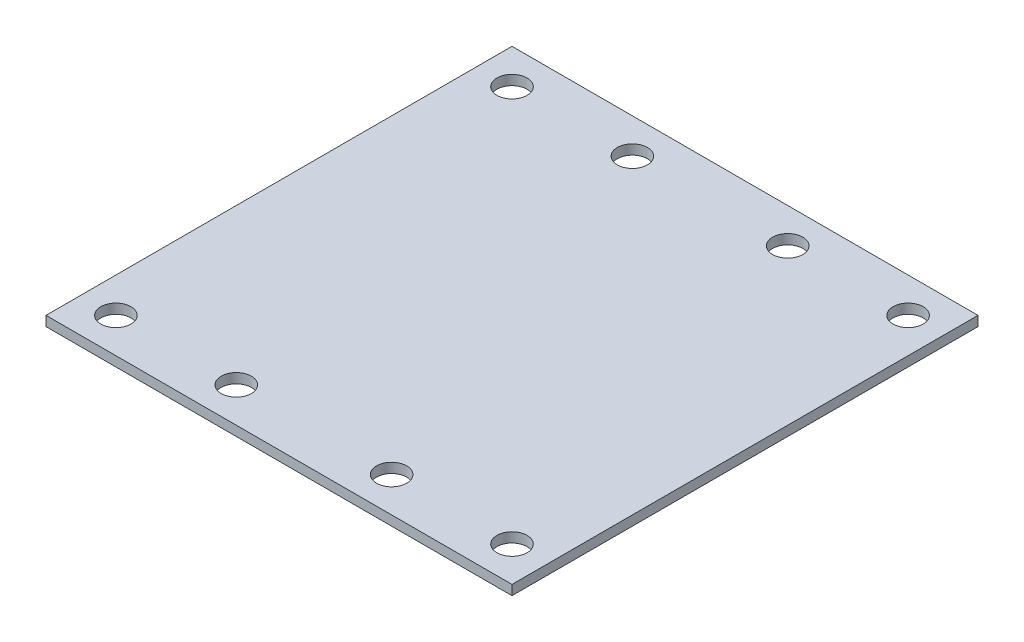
ISO-10303-21;
HEADER;
FILE_DESCRIPTION(('STEP AP214'),'2;1');
FILE_NAME('part.step','',(''),(''),'','','');
FILE_SCHEMA(('AUTOMOTIVE_DESIGN { 1 0 10303 214 1 1 1 1 }'));
ENDSEC;
DATA;
#1=APPLICATION_CONTEXT('core data for automotive mechanical design processes');
#2=APPLICATION_PROTOCOL_DEFINITION('international standard','automotive_design',2000,#1);
#3=PRODUCT_CONTEXT('',#1,'mechanical');
#4=PRODUCT('Part','Part','',(#3));
#5=PRODUCT_RELATED_PRODUCT_CATEGORY('part','',(#4));
#6=PRODUCT_DEFINITION_FORMATION('','',#4);
#7=PRODUCT_DEFINITION_CONTEXT('part definition',#1,'design');
#8=PRODUCT_DEFINITION('design','',#6,#7);
#9=PRODUCT_DEFINITION_SHAPE('','',#8);
#10=(LENGTH_UNIT() NAMED_UNIT(*) SI_UNIT(.MILLI.,.METRE.));
#11=(NAMED_UNIT(*) PLANE_ANGLE_UNIT() SI_UNIT($,.RADIAN.));
#12=(NAMED_UNIT(*) SI_UNIT($,.STERADIAN.) SOLID_ANGLE_UNIT());
#13=UNCERTAINTY_MEASURE_WITH_UNIT(LENGTH_MEASURE(1.E-05),#10,'distance_accuracy_value','');
#14=(GEOMETRIC_REPRESENTATION_CONTEXT(3) GLOBAL_UNCERTAINTY_ASSIGNED_CONTEXT((#13)) GLOBAL_UNIT_ASSIGNED_CONTEXT((#10,
#11,#12)) REPRESENTATION_CONTEXT('',''));
#15=CARTESIAN_POINT('',(0.,0.,0.));
#16=DIRECTION('',(0.,0.,1.));
#17=DIRECTION('',(1.,0.,0.));
#18=AXIS2_PLACEMENT_3D('',#15,#16,#17);
#19=CARTESIAN_POINT('',(0.,1.6002,0.));
#20=DIRECTION('',(0.,-1.,0.));
#21=DIRECTION('',(0.,0.,-1.));
#22=AXIS2_PLACEMENT_3D('',#19,#20,#21);
#23=PLANE('',#22);
#24=CARTESIAN_POINT('',(12.7,1.6002,32.385));
#25=DIRECTION('',(0.,1.,0.));
#26=DIRECTION('',(0.,0.,-1.));
#27=AXIS2_PLACEMENT_3D('',#24,#25,#26);
#28=CIRCLE('',#27,2.4638);
#29=CARTESIAN_POINT('',(12.7,1.6002,29.9212));
#30=VERTEX_POINT('',#29);
#31=EDGE_CURVE('E145',#30,#30,#28,.T.);
#32=ORIENTED_EDGE('',*,*,#31,.F.);
#33=EDGE_LOOP('',(#32));
#34=FACE_BOUND('',#33,.T.);
#35=CARTESIAN_POINT('',(-12.7,1.6002,-32.385));
#36=DIRECTION('',(0.,1.,0.));
#37=DIRECTION('',(0.,0.,1.));
#38=AXIS2_PLACEMENT_3D('',#35,#36,#37);
#39=CIRCLE('',#38,2.4638);
#40=CARTESIAN_POINT('',(-12.7,1.6002,-29.9212));
#41=VERTEX_POINT('',#40);
#42=EDGE_CURVE('E133',#41,#41,#39,.T.);
#43=ORIENTED_EDGE('',*,*,#42,.F.);
#44=EDGE_LOOP('',(#43));
#45=FACE_BOUND('',#44,.T.);
#46=CARTESIAN_POINT('',(32.385,1.6002,32.385));
#47=DIRECTION('',(0.,1.,0.));
#48=DIRECTION('',(0.,0.,1.));
#49=AXIS2_PLACEMENT_3D('',#46,#47,#48);
#50=CIRCLE('',#49,2.4638);
#51=CARTESIAN_POINT('',(32.385,1.6002,34.8488));
#52=VERTEX_POINT('',#51);
#53=EDGE_CURVE('E121',#52,#52,#50,.T.);
#54=ORIENTED_EDGE('',*,*,#53,.F.);
#55=EDGE_LOOP('',(#54));
#56=FACE_BOUND('',#55,.T.);
#57=CARTESIAN_POINT('',(-32.385,1.6002,-32.385));
#58=DIRECTION('',(0.,1.,0.));
#59=DIRECTION('',(0.,0.,1.));
#60=AXIS2_PLACEMENT_3D('',#57,#58,#59);
#61=CIRCLE('',#60,2.4638);
#62=CARTESIAN_POINT('',(-32.385,1.6002,-29.9212));
#63=VERTEX_POINT('',#62);
#64=EDGE_CURVE('E100',#63,#63,#61,.T.);
#65=ORIENTED_EDGE('',*,*,#64,.F.);
#66=EDGE_LOOP('',(#65));
#67=FACE_BOUND('',#66,.T.);
#68=DIRECTION('',(0.,0.,-1.));
#69=VECTOR('',#68,1.);
#70=CARTESIAN_POINT('',(38.1,1.6002,38.1));
#71=LINE('',#70,#69);
#72=CARTESIAN_POINT('',(38.1,1.6002,38.1));
#73=VERTEX_POINT('',#72);
#74=CARTESIAN_POINT('',(38.1,1.6002,-38.1));
#75=VERTEX_POINT('',#74);
#76=EDGE_CURVE('E85',#73,#75,#71,.T.);
#77=ORIENTED_EDGE('',*,*,#76,.T.);
#78=DIRECTION('',(-1.,0.,0.));
#79=VECTOR('',#78,1.);
#80=CARTESIAN_POINT('',(-38.1,1.6002,-38.1));
#81=LINE('',#80,#79);
#82=CARTESIAN_POINT('',(-38.1,1.6002,-38.1));
#83=VERTEX_POINT('',#82);
#84=EDGE_CURVE('E80',#75,#83,#81,.T.);
#85=ORIENTED_EDGE('',*,*,#84,.T.);
#86=DIRECTION('',(0.,0.,1.));
#87=VECTOR('',#86,1.);
#88=CARTESIAN_POINT('',(-38.1,1.6002,38.1));
#89=LINE('',#88,#87);
#90=CARTESIAN_POINT('',(-38.1,1.6002,38.1));
#91=VERTEX_POINT('',#90);
#92=EDGE_CURVE('E83',#83,#91,#89,.T.);
#93=ORIENTED_EDGE('',*,*,#92,.T.);
#94=DIRECTION('',(1.,0.,0.));
#95=VECTOR('',#94,1.);
#96=CARTESIAN_POINT('',(-38.1,1.6002,38.1));
#97=LINE('',#96,#95);
#98=EDGE_CURVE('E50',#91,#73,#97,.T.);
#99=ORIENTED_EDGE('',*,*,#98,.T.);
#100=EDGE_LOOP('',(#77,#85,#93,#99));
#101=FACE_BOUND('',#100,.T.);
#102=CARTESIAN_POINT('',(32.385,1.6002,-32.385));
#103=DIRECTION('',(0.,1.,0.));
#104=DIRECTION('',(0.,0.,1.));
#105=AXIS2_PLACEMENT_3D('',#102,#103,#104);
#106=CIRCLE('',#105,2.4638);
#107=CARTESIAN_POINT('',(32.385,1.6002,-29.9212));
#108=VERTEX_POINT('',#107);
#109=EDGE_CURVE('E115',#108,#108,#106,.T.);
#110=ORIENTED_EDGE('',*,*,#109,.F.);
#111=EDGE_LOOP('',(#110));
#112=FACE_BOUND('',#111,.T.);
#113=CARTESIAN_POINT('',(-32.385,1.6002,32.385));
#114=DIRECTION('',(0.,1.,0.));
#115=DIRECTION('',(0.,0.,1.));
#116=AXIS2_PLACEMENT_3D('',#113,#114,#115);
#117=CIRCLE('',#116,2.4638);
#118=CARTESIAN_POINT('',(-32.385,1.6002,34.8488));
#119=VERTEX_POINT('',#118);
#120=EDGE_CURVE('E127',#119,#119,#117,.T.);
#121=ORIENTED_EDGE('',*,*,#120,.F.);
#122=EDGE_LOOP('',(#121));
#123=FACE_BOUND('',#122,.T.);
#124=CARTESIAN_POINT('',(12.7,1.6002,-32.385));
#125=DIRECTION('',(0.,1.,0.));
#126=DIRECTION('',(0.,0.,1.));
#127=AXIS2_PLACEMENT_3D('',#124,#125,#126);
#128=CIRCLE('',#127,2.4638);
#129=CARTESIAN_POINT('',(12.7,1.6002,-29.9212));
#130=VERTEX_POINT('',#129);
#131=EDGE_CURVE('E139',#130,#130,#128,.T.);
#132=ORIENTED_EDGE('',*,*,#131,.F.);
#133=EDGE_LOOP('',(#132));
#134=FACE_BOUND('',#133,.T.);
#135=CARTESIAN_POINT('',(-12.7,1.6002,32.385));
#136=DIRECTION('',(0.,1.,0.));
#137=DIRECTION('',(0.,0.,-1.));
#138=AXIS2_PLACEMENT_3D('',#135,#136,#137);
#139=CIRCLE('',#138,2.4638);
#140=CARTESIAN_POINT('',(-12.7,1.6002,29.9212));
#141=VERTEX_POINT('',#140);
#142=EDGE_CURVE('E151',#141,#141,#139,.T.);
#143=ORIENTED_EDGE('',*,*,#142,.F.);
#144=EDGE_LOOP('',(#143));
#145=FACE_BOUND('',#144,.T.);
#146=ADVANCED_FACE('F33',(#34,#45,#56,#67,#101,#112,#123,#134,#145),#23,.F.);
#147=CARTESIAN_POINT('',(0.,0.,0.));
#148=DIRECTION('',(0.,-1.,0.));
#149=DIRECTION('',(0.,0.,-1.));
#150=AXIS2_PLACEMENT_3D('',#147,#148,#149);
#151=PLANE('',#150);
#152=CARTESIAN_POINT('',(12.7,0.,32.385));
#153=DIRECTION('',(0.,1.,0.));
#154=DIRECTION('',(0.,0.,-1.));
#155=AXIS2_PLACEMENT_3D('',#152,#153,#154);
#156=CIRCLE('',#155,2.4638);
#157=CARTESIAN_POINT('',(12.7,0.,29.9212));
#158=VERTEX_POINT('',#157);
#159=EDGE_CURVE('E148',#158,#158,#156,.T.);
#160=ORIENTED_EDGE('',*,*,#159,.T.);
#161=EDGE_LOOP('',(#160));
#162=FACE_BOUND('',#161,.T.);
#163=CARTESIAN_POINT('',(-12.7,0.,-32.385));
#164=DIRECTION('',(0.,1.,0.));
#165=DIRECTION('',(0.,0.,1.));
#166=AXIS2_PLACEMENT_3D('',#163,#164,#165);
#167=CIRCLE('',#166,2.4638);
#168=CARTESIAN_POINT('',(-12.7,0.,-29.9212));
#169=VERTEX_POINT('',#168);
#170=EDGE_CURVE('E136',#169,#169,#167,.T.);
#171=ORIENTED_EDGE('',*,*,#170,.T.);
#172=EDGE_LOOP('',(#171));
#173=FACE_BOUND('',#172,.T.);
#174=CARTESIAN_POINT('',(32.385,0.,32.385));
#175=DIRECTION('',(0.,1.,0.));
#176=DIRECTION('',(0.,0.,1.));
#177=AXIS2_PLACEMENT_3D('',#174,#175,#176);
#178=CIRCLE('',#177,2.4638);
#179=CARTESIAN_POINT('',(32.385,0.,34.8488));
#180=VERTEX_POINT('',#179);
#181=EDGE_CURVE('E124',#180,#180,#178,.T.);
#182=ORIENTED_EDGE('',*,*,#181,.T.);
#183=EDGE_LOOP('',(#182));
#184=FACE_BOUND('',#183,.T.);
#185=CARTESIAN_POINT('',(-32.385,0.,-32.385));
#186=DIRECTION('',(0.,1.,0.));
#187=DIRECTION('',(0.,0.,1.));
#188=AXIS2_PLACEMENT_3D('',#185,#186,#187);
#189=CIRCLE('',#188,2.4638);
#190=CARTESIAN_POINT('',(-32.385,0.,-29.9212));
#191=VERTEX_POINT('',#190);
#192=EDGE_CURVE('E112',#191,#191,#189,.T.);
#193=ORIENTED_EDGE('',*,*,#192,.T.);
#194=EDGE_LOOP('',(#193));
#195=FACE_BOUND('',#194,.T.);
#196=DIRECTION('',(0.,0.,-1.));
#197=VECTOR('',#196,1.);
#198=CARTESIAN_POINT('',(38.1,0.,38.1));
#199=LINE('',#198,#197);
#200=CARTESIAN_POINT('',(38.1,0.,38.1));
#201=VERTEX_POINT('',#200);
#202=CARTESIAN_POINT('',(38.1,0.,-38.1));
#203=VERTEX_POINT('',#202);
#204=EDGE_CURVE('E97',#201,#203,#199,.T.);
#205=ORIENTED_EDGE('',*,*,#204,.F.);
#206=DIRECTION('',(1.,0.,0.));
#207=VECTOR('',#206,1.);
#208=CARTESIAN_POINT('',(-38.1,0.,38.1));
#209=LINE('',#208,#207);
#210=CARTESIAN_POINT('',(-38.1,0.,38.1));
#211=VERTEX_POINT('',#210);
#212=EDGE_CURVE('E73',#211,#201,#209,.T.);
#213=ORIENTED_EDGE('',*,*,#212,.F.);
#214=DIRECTION('',(0.,0.,1.));
#215=VECTOR('',#214,1.);
#216=CARTESIAN_POINT('',(-38.1,0.,38.1));
#217=LINE('',#216,#215);
#218=CARTESIAN_POINT('',(-38.1,0.,-38.1));
#219=VERTEX_POINT('',#218);
#220=EDGE_CURVE('E67',#219,#211,#217,.T.);
#221=ORIENTED_EDGE('',*,*,#220,.F.);
#222=DIRECTION('',(-1.,0.,0.));
#223=VECTOR('',#222,1.);
#224=CARTESIAN_POINT('',(-38.1,0.,-38.1));
#225=LINE('',#224,#223);
#226=EDGE_CURVE('E89',#203,#219,#225,.T.);
#227=ORIENTED_EDGE('',*,*,#226,.F.);
#228=EDGE_LOOP('',(#205,#213,#221,#227));
#229=FACE_BOUND('',#228,.T.);
#230=CARTESIAN_POINT('',(32.385,0.,-32.385));
#231=DIRECTION('',(0.,1.,0.));
#232=DIRECTION('',(0.,0.,1.));
#233=AXIS2_PLACEMENT_3D('',#230,#231,#232);
#234=CIRCLE('',#233,2.4638);
#235=CARTESIAN_POINT('',(32.385,0.,-29.9212));
#236=VERTEX_POINT('',#235);
#237=EDGE_CURVE('E118',#236,#236,#234,.T.);
#238=ORIENTED_EDGE('',*,*,#237,.T.);
#239=EDGE_LOOP('',(#238));
#240=FACE_BOUND('',#239,.T.);
#241=CARTESIAN_POINT('',(-32.385,0.,32.385));
#242=DIRECTION('',(0.,1.,0.));
#243=DIRECTION('',(0.,0.,1.));
#244=AXIS2_PLACEMENT_3D('',#241,#242,#243);
#245=CIRCLE('',#244,2.4638);
#246=CARTESIAN_POINT('',(-32.385,0.,34.8488));
#247=VERTEX_POINT('',#246);
#248=EDGE_CURVE('E130',#247,#247,#245,.T.);
#249=ORIENTED_EDGE('',*,*,#248,.T.);
#250=EDGE_LOOP('',(#249));
#251=FACE_BOUND('',#250,.T.);
#252=CARTESIAN_POINT('',(12.7,0.,-32.385));
#253=DIRECTION('',(0.,1.,0.));
#254=DIRECTION('',(0.,0.,1.));
#255=AXIS2_PLACEMENT_3D('',#252,#253,#254);
#256=CIRCLE('',#255,2.4638);
#257=CARTESIAN_POINT('',(12.7,0.,-29.9212));
#258=VERTEX_POINT('',#257);
#259=EDGE_CURVE('E142',#258,#258,#256,.T.);
#260=ORIENTED_EDGE('',*,*,#259,.T.);
#261=EDGE_LOOP('',(#260));
#262=FACE_BOUND('',#261,.T.);
#263=CARTESIAN_POINT('',(-12.7,0.,32.385));
#264=DIRECTION('',(0.,1.,0.));
#265=DIRECTION('',(0.,0.,-1.));
#266=AXIS2_PLACEMENT_3D('',#263,#264,#265);
#267=CIRCLE('',#266,2.4638);
#268=CARTESIAN_POINT('',(-12.7,0.,29.9212));
#269=VERTEX_POINT('',#268);
#270=EDGE_CURVE('E154',#269,#269,#267,.T.);
#271=ORIENTED_EDGE('',*,*,#270,.T.);
#272=EDGE_LOOP('',(#271));
#273=FACE_BOUND('',#272,.T.);
#274=ADVANCED_FACE('F108',(#162,#173,#184,#195,#229,#240,#251,#262,#273),#151,.T.);
#275=CARTESIAN_POINT('',(38.1,1.6002,38.1));
#276=DIRECTION('',(-1.,0.,0.));
#277=DIRECTION('',(0.,0.,1.));
#278=AXIS2_PLACEMENT_3D('',#275,#276,#277);
#279=PLANE('',#278);
#280=ORIENTED_EDGE('',*,*,#204,.T.);
#281=DIRECTION('',(0.,-1.,0.));
#282=VECTOR('',#281,1.);
#283=CARTESIAN_POINT('',(38.1,1.6002,-38.1));
#284=LINE('',#283,#282);
#285=EDGE_CURVE('E11',#75,#203,#284,.T.);
#286=ORIENTED_EDGE('',*,*,#285,.F.);
#287=ORIENTED_EDGE('',*,*,#76,.F.);
#288=DIRECTION('',(0.,-1.,0.));
#289=VECTOR('',#288,1.);
#290=CARTESIAN_POINT('',(38.1,1.6002,38.1));
#291=LINE('',#290,#289);
#292=EDGE_CURVE('E93',#73,#201,#291,.T.);
#293=ORIENTED_EDGE('',*,*,#292,.T.);
#294=EDGE_LOOP('',(#280,#286,#287,#293));
#295=FACE_BOUND('',#294,.T.);
#296=ADVANCED_FACE('F35',(#295),#279,.F.);
#297=CARTESIAN_POINT('',(-38.1,1.6002,-38.1));
#298=DIRECTION('',(0.,0.,1.));
#299=DIRECTION('',(1.,0.,0.));
#300=AXIS2_PLACEMENT_3D('',#297,#298,#299);
#301=PLANE('',#300);
#302=ORIENTED_EDGE('',*,*,#226,.T.);
#303=DIRECTION('',(0.,-1.,0.));
#304=VECTOR('',#303,1.);
#305=CARTESIAN_POINT('',(-38.1,1.6002,-38.1));
#306=LINE('',#305,#304);
#307=EDGE_CURVE('E42',#83,#219,#306,.T.);
#308=ORIENTED_EDGE('',*,*,#307,.F.);
#309=ORIENTED_EDGE('',*,*,#84,.F.);
#310=ORIENTED_EDGE('',*,*,#285,.T.);
#311=EDGE_LOOP('',(#302,#308,#309,#310));
#312=FACE_BOUND('',#311,.T.);
#313=ADVANCED_FACE('F88',(#312),#301,.F.);
#314=CARTESIAN_POINT('',(-38.1,1.6002,38.1));
#315=DIRECTION('',(1.,0.,0.));
#316=DIRECTION('',(0.,0.,-1.));
#317=AXIS2_PLACEMENT_3D('',#314,#315,#316);
#318=PLANE('',#317);
#319=ORIENTED_EDGE('',*,*,#220,.T.);
#320=DIRECTION('',(0.,-1.,0.));
#321=VECTOR('',#320,1.);
#322=CARTESIAN_POINT('',(-38.1,1.6002,38.1));
#323=LINE('',#322,#321);
#324=EDGE_CURVE('E90',#91,#211,#323,.T.);
#325=ORIENTED_EDGE('',*,*,#324,.F.);
#326=ORIENTED_EDGE('',*,*,#92,.F.);
#327=ORIENTED_EDGE('',*,*,#307,.T.);
#328=EDGE_LOOP('',(#319,#325,#326,#327));
#329=FACE_BOUND('',#328,.T.);
#330=ADVANCED_FACE('F91',(#329),#318,.F.);
#331=CARTESIAN_POINT('',(-38.1,1.6002,38.1));
#332=DIRECTION('',(0.,0.,-1.));
#333=DIRECTION('',(-1.,0.,0.));
#334=AXIS2_PLACEMENT_3D('',#331,#332,#333);
#335=PLANE('',#334);
#336=ORIENTED_EDGE('',*,*,#212,.T.);
#337=ORIENTED_EDGE('',*,*,#292,.F.);
#338=ORIENTED_EDGE('',*,*,#98,.F.);
#339=ORIENTED_EDGE('',*,*,#324,.T.);
#340=EDGE_LOOP('',(#336,#337,#338,#339));
#341=FACE_BOUND('',#340,.T.);
#342=ADVANCED_FACE('F105',(#341),#335,.F.);
#343=CARTESIAN_POINT('',(-32.385,1.6002,-32.385));
#344=DIRECTION('',(0.,-1.,0.));
#345=DIRECTION('',(0.,0.,-1.));
#346=AXIS2_PLACEMENT_3D('',#343,#344,#345);
#347=CYLINDRICAL_SURFACE('',#346,2.4638);
#348=ORIENTED_EDGE('',*,*,#64,.T.);
#349=EDGE_LOOP('',(#348));
#350=FACE_BOUND('',#349,.T.);
#351=ORIENTED_EDGE('',*,*,#192,.F.);
#352=EDGE_LOOP('',(#351));
#353=FACE_BOUND('',#352,.T.);
#354=ADVANCED_FACE('F174',(#350,#353),#347,.F.);
#355=CARTESIAN_POINT('',(32.385,1.6002,-32.385));
#356=DIRECTION('',(0.,-1.,0.));
#357=DIRECTION('',(0.,0.,-1.));
#358=AXIS2_PLACEMENT_3D('',#355,#356,#357);
#359=CYLINDRICAL_SURFACE('',#358,2.4638);
#360=ORIENTED_EDGE('',*,*,#109,.T.);
#361=EDGE_LOOP('',(#360));
#362=FACE_BOUND('',#361,.T.);
#363=ORIENTED_EDGE('',*,*,#237,.F.);
#364=EDGE_LOOP('',(#363));
#365=FACE_BOUND('',#364,.T.);
#366=ADVANCED_FACE('F220',(#362,#365),#359,.F.);
#367=CARTESIAN_POINT('',(32.385,1.6002,32.385));
#368=DIRECTION('',(0.,-1.,0.));
#369=DIRECTION('',(0.,0.,-1.));
#370=AXIS2_PLACEMENT_3D('',#367,#368,#369);
#371=CYLINDRICAL_SURFACE('',#370,2.4638);
#372=ORIENTED_EDGE('',*,*,#53,.T.);
#373=EDGE_LOOP('',(#372));
#374=FACE_BOUND('',#373,.T.);
#375=ORIENTED_EDGE('',*,*,#181,.F.);
#376=EDGE_LOOP('',(#375));
#377=FACE_BOUND('',#376,.T.);
#378=ADVANCED_FACE('F228',(#374,#377),#371,.F.);
#379=CARTESIAN_POINT('',(-32.385,1.6002,32.385));
#380=DIRECTION('',(0.,-1.,0.));
#381=DIRECTION('',(0.,0.,-1.));
#382=AXIS2_PLACEMENT_3D('',#379,#380,#381);
#383=CYLINDRICAL_SURFACE('',#382,2.4638);
#384=ORIENTED_EDGE('',*,*,#120,.T.);
#385=EDGE_LOOP('',(#384));
#386=FACE_BOUND('',#385,.T.);
#387=ORIENTED_EDGE('',*,*,#248,.F.);
#388=EDGE_LOOP('',(#387));
#389=FACE_BOUND('',#388,.T.);
#390=ADVANCED_FACE('F236',(#386,#389),#383,.F.);
#391=CARTESIAN_POINT('',(-12.7,1.6002,-32.385));
#392=DIRECTION('',(0.,-1.,0.));
#393=DIRECTION('',(0.,0.,-1.));
#394=AXIS2_PLACEMENT_3D('',#391,#392,#393);
#395=CYLINDRICAL_SURFACE('',#394,2.4638);
#396=ORIENTED_EDGE('',*,*,#42,.T.);
#397=EDGE_LOOP('',(#396));
#398=FACE_BOUND('',#397,.T.);
#399=ORIENTED_EDGE('',*,*,#170,.F.);
#400=EDGE_LOOP('',(#399));
#401=FACE_BOUND('',#400,.T.);
#402=ADVANCED_FACE('F245',(#398,#401),#395,.F.);
#403=CARTESIAN_POINT('',(12.7,1.6002,-32.385));
#404=DIRECTION('',(0.,-1.,0.));
#405=DIRECTION('',(0.,0.,-1.));
#406=AXIS2_PLACEMENT_3D('',#403,#404,#405);
#407=CYLINDRICAL_SURFACE('',#406,2.4638);
#408=ORIENTED_EDGE('',*,*,#131,.T.);
#409=EDGE_LOOP('',(#408));
#410=FACE_BOUND('',#409,.T.);
#411=ORIENTED_EDGE('',*,*,#259,.F.);
#412=EDGE_LOOP('',(#411));
#413=FACE_BOUND('',#412,.T.);
#414=ADVANCED_FACE('F254',(#410,#413),#407,.F.);
#415=CARTESIAN_POINT('',(12.7,1.6002,32.385));
#416=DIRECTION('',(0.,-1.,0.));
#417=DIRECTION('',(0.,0.,-1.));
#418=AXIS2_PLACEMENT_3D('',#415,#416,#417);
#419=CYLINDRICAL_SURFACE('',#418,2.4638);
#420=ORIENTED_EDGE('',*,*,#31,.T.);
#421=EDGE_LOOP('',(#420));
#422=FACE_BOUND('',#421,.T.);
#423=ORIENTED_EDGE('',*,*,#159,.F.);
#424=EDGE_LOOP('',(#423));
#425=FACE_BOUND('',#424,.T.);
#426=ADVANCED_FACE('F263',(#422,#425),#419,.F.);
#427=CARTESIAN_POINT('',(-12.7,1.6002,32.385));
#428=DIRECTION('',(0.,-1.,0.));
#429=DIRECTION('',(0.,0.,-1.));
#430=AXIS2_PLACEMENT_3D('',#427,#428,#429);
#431=CYLINDRICAL_SURFACE('',#430,2.4638);
#432=ORIENTED_EDGE('',*,*,#142,.T.);
#433=EDGE_LOOP('',(#432));
#434=FACE_BOUND('',#433,.T.);
#435=ORIENTED_EDGE('',*,*,#270,.F.);
#436=EDGE_LOOP('',(#435));
#437=FACE_BOUND('',#436,.T.);
#438=ADVANCED_FACE('F160',(#434,#437),#431,.F.);
#439=CLOSED_SHELL('',(#146,#274,#296,#313,#330,#342,#354,#366,#378,#390,#402,#414,#426,#438));
#440=MANIFOLD_SOLID_BREP('B2',#439);
#441=ADVANCED_BREP_SHAPE_REPRESENTATION('',(#18,#440),#14);
#442=SHAPE_DEFINITION_REPRESENTATION(#9,#441);
ENDSEC;
END-ISO-10303-21;
